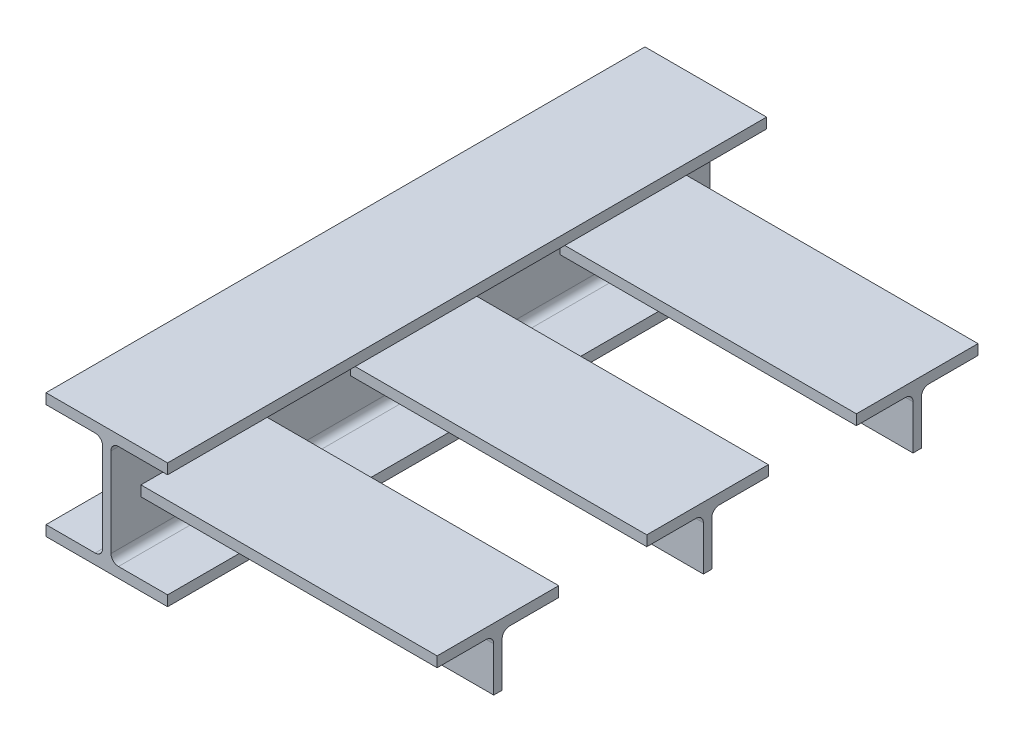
from build123d import *

# Parameters (mm, degrees)
WF_START        = -254
WF_DEPTH        = 508
TEE_REACH       = 462.921
LPATTERN1_COUNT = 3
LPATTERN1_PITCH = 177.8


with BuildPart() as part:
    # Sketch1 → WF (new body)
    with BuildSketch(Plane.XY.offset(WF_START)):
        with BuildLine():
            Line((0, 0), (0, 8.76299241))
            Line((0, 8.76299241), (41.65596392, 8.76299241))
            ThreePointArc((41.65596392, 8.76299241), (46.146088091, 10.622862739), (48.00595842, 15.11298691))
            Line((48.00595842, 15.11298691), (48.00595842, 90.55092157))
            ThreePointArc((48.00595842, 90.55092157), (46.146088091, 95.041045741), (41.65596392, 96.90091607))
            Line((41.65596392, 96.90091607), (0, 96.90091607))
            Line((0, 96.90091607), (0, 105.66390848))
            Line((0, 105.66390848), (103.12391068, 105.66390848))
            Line((103.12391068, 105.66390848), (103.12391068, 96.90091607))
            Line((103.12391068, 96.90091607), (61.46794676, 96.90091607))
            ThreePointArc((61.46794676, 96.90091607), (56.977822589, 95.041045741), (55.11795226, 90.55092157))
            Line((55.11795226, 90.55092157), (55.11795226, 15.11298691))
            ThreePointArc((55.11795226, 15.11298691), (56.977822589, 10.622862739), (61.46794676, 8.76299241))
            Line((61.46794676, 8.76299241), (103.12391068, 8.76299241))
            Line((103.12391068, 8.76299241), (103.12391068, 0))
            Line((103.12391068, 0), (0, 0))
        make_face()
    extrude(amount=WF_DEPTH)


with BuildPart() as body_2:

    # Sketch2 → TEE (new, up to next)
    with BuildSketch(Plane(origin=(306.32391068, -23.587346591, 65.230946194), x_dir=(0, 0, -1), z_dir=(1, 0, 0)), mode=Mode.PRIVATE) as tee_sk1:
        with BuildLine():
            Line((-115.363095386, 23.587346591), (-108.251101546, 23.587346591))
            Line((-108.251101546, 23.587346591), (-108.251101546, 61.306359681))
            ThreePointArc((-108.251101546, 61.306359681), (-106.391231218, 65.796483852), (-101.901107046, 67.656354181))
            Line((-101.901107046, 67.656354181), (-60.245143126, 67.656354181))
            Line((-60.245143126, 67.656354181), (-60.245143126, 76.419346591))
            Line((-60.245143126, 76.419346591), (-163.369053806, 76.419346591))
            Line((-163.369053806, 76.419346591), (-163.369053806, 67.656354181))
            Line((-163.369053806, 67.656354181), (-121.713089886, 67.656354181))
            ThreePointArc((-121.713089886, 67.656354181), (-117.222965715, 65.796483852), (-115.363095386, 61.306359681))
            Line((-115.363095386, 61.306359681), (-115.363095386, 23.587346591))
        make_face()
    tee_tool1 = extrude(tee_sk1.sketch, amount=-TEE_REACH, mode=Mode.PRIVATE) - part.part
    add(tee_tool1.solids().sort_by_distance((306.323911, 41.662068, 177.038045))[0])


with BuildPart() as lpattern1_1:
    # LPattern1: pattern copy
    add(body_2.part.moved(Location(Vector(0, 0, -1) * (1 * LPATTERN1_PITCH))))


with BuildPart() as lpattern1_2:
    # LPattern1: pattern copy
    add(body_2.part.moved(Location(Vector(0, 0, -1) * (2 * LPATTERN1_PITCH))))


solid = Compound([part.part, body_2.part, lpattern1_1.part, lpattern1_2.part])
